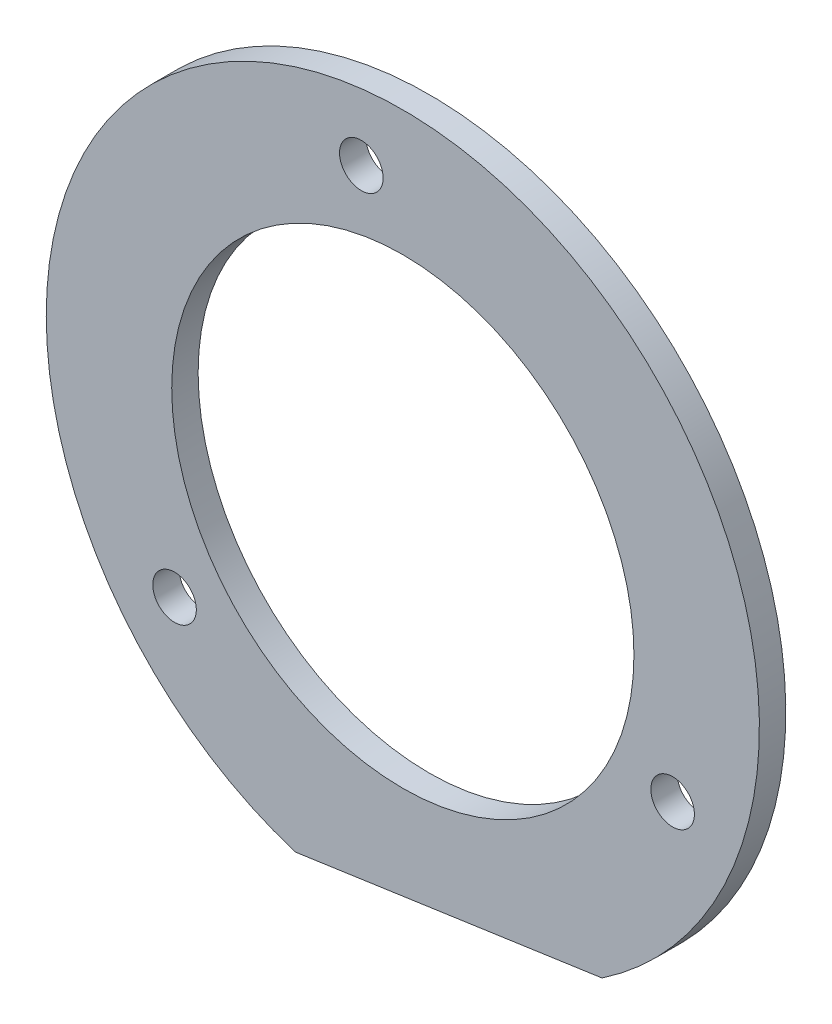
from build123d import *

# Parameters (mm, degrees)
SKETCH_2_R         = 17.5
EXTRUDE_1_DEPTH    = 2
HOLE_WIZARD_M4_1_D = 3.3


with BuildPart() as part:
    # Sketch 2 → Extrude 1 (new body)
    with BuildSketch(Plane(origin=(0, 0, -6), x_dir=(-1, 0, 0), z_dir=(0, 0, -1))):
        with BuildLine():
            Line((-15.083643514, -22.393831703), (8.135310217, -25.745227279))
            ThreePointArc((8.135310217, -25.745227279), (3.85717474, 26.723065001), (-15.083643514, -22.393831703))
        make_face()
        Circle(SKETCH_2_R, mode=Mode.SUBTRACT)
    extrude(amount=EXTRUDE_1_DEPTH)

    # Hole Wizard M4 _1 (through all)
    with Locations(Plane(origin=(0, 0, -8), x_dir=(-1, 0, 0), z_dir=(0, 0, -1))):
        with Locations((-20.428581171, -8.165358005), (17.285698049, -13.608991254), (3.142883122, 21.77434926)):
            Hole(HOLE_WIZARD_M4_1_D / 2)


solid = part.part
